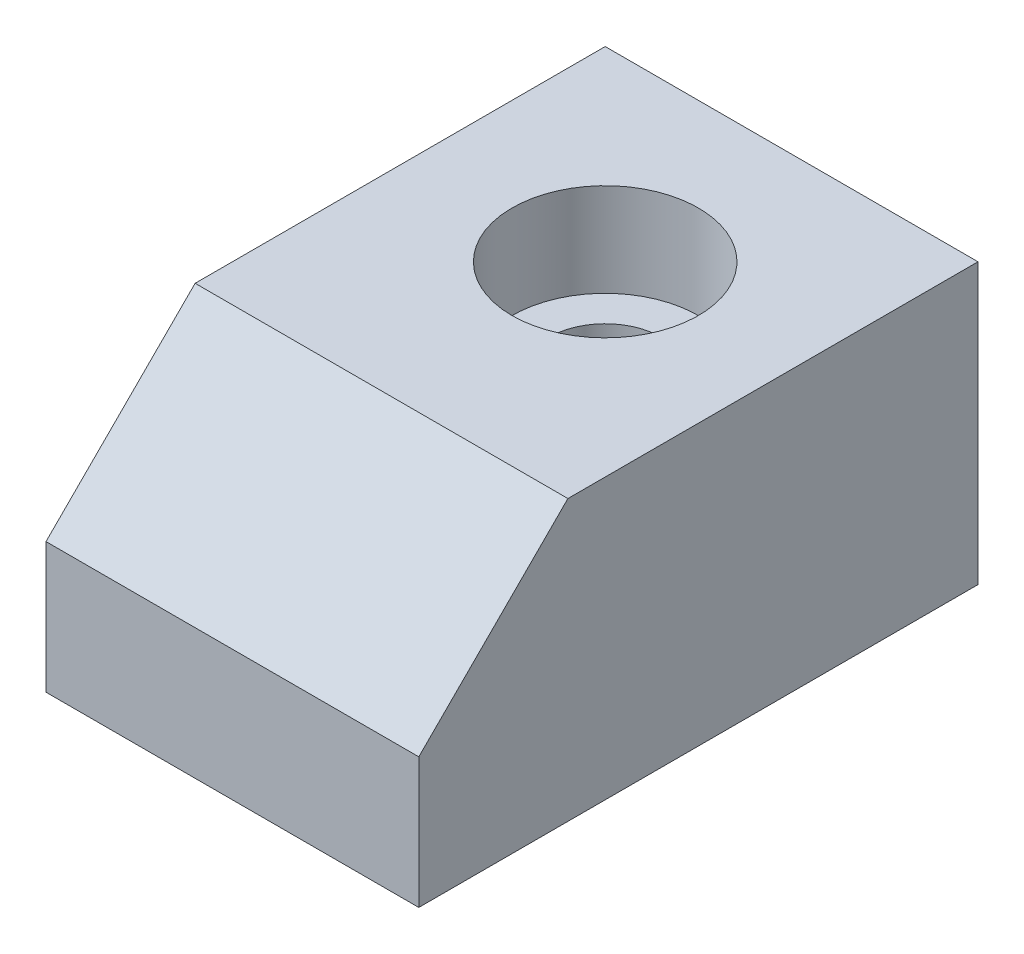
ISO-10303-21;
HEADER;
FILE_DESCRIPTION(('STEP AP214'),'2;1');
FILE_NAME('part.step','',(''),(''),'','','');
FILE_SCHEMA(('AUTOMOTIVE_DESIGN { 1 0 10303 214 1 1 1 1 }'));
ENDSEC;
DATA;
#1=APPLICATION_CONTEXT('core data for automotive mechanical design processes');
#2=APPLICATION_PROTOCOL_DEFINITION('international standard','automotive_design',2000,#1);
#3=PRODUCT_CONTEXT('',#1,'mechanical');
#4=PRODUCT('Part','Part','',(#3));
#5=PRODUCT_RELATED_PRODUCT_CATEGORY('part','',(#4));
#6=PRODUCT_DEFINITION_FORMATION('','',#4);
#7=PRODUCT_DEFINITION_CONTEXT('part definition',#1,'design');
#8=PRODUCT_DEFINITION('design','',#6,#7);
#9=PRODUCT_DEFINITION_SHAPE('','',#8);
#10=(LENGTH_UNIT() NAMED_UNIT(*) SI_UNIT(.MILLI.,.METRE.));
#11=(NAMED_UNIT(*) PLANE_ANGLE_UNIT() SI_UNIT($,.RADIAN.));
#12=(NAMED_UNIT(*) SI_UNIT($,.STERADIAN.) SOLID_ANGLE_UNIT());
#13=UNCERTAINTY_MEASURE_WITH_UNIT(LENGTH_MEASURE(1.E-05),#10,'distance_accuracy_value','');
#14=(GEOMETRIC_REPRESENTATION_CONTEXT(3) GLOBAL_UNCERTAINTY_ASSIGNED_CONTEXT((#13)) GLOBAL_UNIT_ASSIGNED_CONTEXT((#10,
#11,#12)) REPRESENTATION_CONTEXT('',''));
#15=CARTESIAN_POINT('',(0.,0.,0.));
#16=DIRECTION('',(0.,0.,1.));
#17=DIRECTION('',(1.,0.,0.));
#18=AXIS2_PLACEMENT_3D('',#15,#16,#17);
#19=CARTESIAN_POINT('',(20.,-7.5,-15.));
#20=DIRECTION('',(0.,0.,1.));
#21=DIRECTION('',(1.,0.,0.));
#22=AXIS2_PLACEMENT_3D('',#19,#20,#21);
#23=PLANE('',#22);
#24=DIRECTION('',(0.,1.,0.));
#25=VECTOR('',#24,1.);
#26=CARTESIAN_POINT('',(0.,-7.5,-15.));
#27=LINE('',#26,#25);
#28=CARTESIAN_POINT('',(0.,-7.5,-15.));
#29=VERTEX_POINT('',#28);
#30=CARTESIAN_POINT('',(0.,7.5,-15.));
#31=VERTEX_POINT('',#30);
#32=EDGE_CURVE('E108',#29,#31,#27,.T.);
#33=ORIENTED_EDGE('',*,*,#32,.T.);
#34=DIRECTION('',(-1.,0.,0.));
#35=VECTOR('',#34,1.);
#36=CARTESIAN_POINT('',(20.,7.5,-15.));
#37=LINE('',#36,#35);
#38=CARTESIAN_POINT('',(20.,7.5,-15.));
#39=VERTEX_POINT('',#38);
#40=EDGE_CURVE('E11',#39,#31,#37,.T.);
#41=ORIENTED_EDGE('',*,*,#40,.F.);
#42=DIRECTION('',(0.,1.,0.));
#43=VECTOR('',#42,1.);
#44=CARTESIAN_POINT('',(20.,-7.5,-15.));
#45=LINE('',#44,#43);
#46=CARTESIAN_POINT('',(20.,-7.5,-15.));
#47=VERTEX_POINT('',#46);
#48=EDGE_CURVE('E106',#47,#39,#45,.T.);
#49=ORIENTED_EDGE('',*,*,#48,.F.);
#50=DIRECTION('',(-1.,0.,0.));
#51=VECTOR('',#50,1.);
#52=CARTESIAN_POINT('',(20.,-7.5,-15.));
#53=LINE('',#52,#51);
#54=EDGE_CURVE('E112',#47,#29,#53,.T.);
#55=ORIENTED_EDGE('',*,*,#54,.T.);
#56=EDGE_LOOP('',(#33,#41,#49,#55));
#57=FACE_BOUND('',#56,.T.);
#58=ADVANCED_FACE('F33',(#57),#23,.F.);
#59=CARTESIAN_POINT('',(20.,7.5,15.));
#60=DIRECTION('',(0.,-1.,0.));
#61=DIRECTION('',(0.,0.,-1.));
#62=AXIS2_PLACEMENT_3D('',#59,#60,#61);
#63=PLANE('',#62);
#64=CARTESIAN_POINT('',(10.,7.5,-5.));
#65=DIRECTION('',(0.,1.,0.));
#66=DIRECTION('',(0.,0.,1.));
#67=AXIS2_PLACEMENT_3D('',#64,#65,#66);
#68=CIRCLE('',#67,5.);
#69=CARTESIAN_POINT('',(10.,7.5,0.));
#70=VERTEX_POINT('',#69);
#71=EDGE_CURVE('E134',#70,#70,#68,.T.);
#72=ORIENTED_EDGE('',*,*,#71,.F.);
#73=EDGE_LOOP('',(#72));
#74=FACE_BOUND('',#73,.T.);
#75=DIRECTION('',(0.,0.,1.));
#76=VECTOR('',#75,1.);
#77=CARTESIAN_POINT('',(0.,7.5,15.));
#78=LINE('',#77,#76);
#79=CARTESIAN_POINT('',(0.,7.5,7.00000000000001));
#80=VERTEX_POINT('',#79);
#81=EDGE_CURVE('E104',#31,#80,#78,.T.);
#82=ORIENTED_EDGE('',*,*,#81,.T.);
#83=DIRECTION('',(1.,0.,0.));
#84=VECTOR('',#83,1.);
#85=CARTESIAN_POINT('',(0.,7.5,7.));
#86=LINE('',#85,#84);
#87=CARTESIAN_POINT('',(20.,7.5,7.));
#88=VERTEX_POINT('',#87);
#89=EDGE_CURVE('E47',#80,#88,#86,.T.);
#90=ORIENTED_EDGE('',*,*,#89,.T.);
#91=DIRECTION('',(0.,0.,1.));
#92=VECTOR('',#91,1.);
#93=CARTESIAN_POINT('',(20.,7.5,15.));
#94=LINE('',#93,#92);
#95=EDGE_CURVE('E78',#39,#88,#94,.T.);
#96=ORIENTED_EDGE('',*,*,#95,.F.);
#97=ORIENTED_EDGE('',*,*,#40,.T.);
#98=EDGE_LOOP('',(#82,#90,#96,#97));
#99=FACE_BOUND('',#98,.T.);
#100=ADVANCED_FACE('F133',(#74,#99),#63,.F.);
#101=CARTESIAN_POINT('',(20.,-7.5,15.));
#102=DIRECTION('',(0.,0.,-1.));
#103=DIRECTION('',(-1.,0.,0.));
#104=AXIS2_PLACEMENT_3D('',#101,#102,#103);
#105=PLANE('',#104);
#106=DIRECTION('',(0.,-1.,0.));
#107=VECTOR('',#106,1.);
#108=CARTESIAN_POINT('',(20.,-7.5,15.));
#109=LINE('',#108,#107);
#110=CARTESIAN_POINT('',(20.,-0.5,15.));
#111=VERTEX_POINT('',#110);
#112=CARTESIAN_POINT('',(20.,-7.5,15.));
#113=VERTEX_POINT('',#112);
#114=EDGE_CURVE('E100',#111,#113,#109,.T.);
#115=ORIENTED_EDGE('',*,*,#114,.F.);
#116=DIRECTION('',(1.,0.,0.));
#117=VECTOR('',#116,1.);
#118=CARTESIAN_POINT('',(0.,-0.5,15.));
#119=LINE('',#118,#117);
#120=CARTESIAN_POINT('',(0.,-0.5,15.));
#121=VERTEX_POINT('',#120);
#122=EDGE_CURVE('E88',#121,#111,#119,.T.);
#123=ORIENTED_EDGE('',*,*,#122,.F.);
#124=DIRECTION('',(0.,-1.,0.));
#125=VECTOR('',#124,1.);
#126=CARTESIAN_POINT('',(0.,-7.5,15.));
#127=LINE('',#126,#125);
#128=CARTESIAN_POINT('',(0.,-7.5,15.));
#129=VERTEX_POINT('',#128);
#130=EDGE_CURVE('E99',#121,#129,#127,.T.);
#131=ORIENTED_EDGE('',*,*,#130,.T.);
#132=DIRECTION('',(-1.,0.,0.));
#133=VECTOR('',#132,1.);
#134=CARTESIAN_POINT('',(20.,-7.5,15.));
#135=LINE('',#134,#133);
#136=EDGE_CURVE('E40',#113,#129,#135,.T.);
#137=ORIENTED_EDGE('',*,*,#136,.F.);
#138=EDGE_LOOP('',(#115,#123,#131,#137));
#139=FACE_BOUND('',#138,.T.);
#140=ADVANCED_FACE('F97',(#139),#105,.F.);
#141=CARTESIAN_POINT('',(20.,-7.5,15.));
#142=DIRECTION('',(0.,1.,0.));
#143=DIRECTION('',(0.,0.,1.));
#144=AXIS2_PLACEMENT_3D('',#141,#142,#143);
#145=PLANE('',#144);
#146=CARTESIAN_POINT('',(10.,-7.5,-5.));
#147=DIRECTION('',(0.,1.,0.));
#148=DIRECTION('',(0.,0.,1.));
#149=AXIS2_PLACEMENT_3D('',#146,#147,#148);
#150=CIRCLE('',#149,3.);
#151=CARTESIAN_POINT('',(10.,-7.5,-2.));
#152=VERTEX_POINT('',#151);
#153=EDGE_CURVE('E119',#152,#152,#150,.T.);
#154=ORIENTED_EDGE('',*,*,#153,.T.);
#155=EDGE_LOOP('',(#154));
#156=FACE_BOUND('',#155,.T.);
#157=DIRECTION('',(0.,0.,-1.));
#158=VECTOR('',#157,1.);
#159=CARTESIAN_POINT('',(0.,-7.5,15.));
#160=LINE('',#159,#158);
#161=EDGE_CURVE('E73',#129,#29,#160,.T.);
#162=ORIENTED_EDGE('',*,*,#161,.T.);
#163=ORIENTED_EDGE('',*,*,#54,.F.);
#164=DIRECTION('',(0.,0.,-1.));
#165=VECTOR('',#164,1.);
#166=CARTESIAN_POINT('',(20.,-7.5,15.));
#167=LINE('',#166,#165);
#168=EDGE_CURVE('E56',#113,#47,#167,.T.);
#169=ORIENTED_EDGE('',*,*,#168,.F.);
#170=ORIENTED_EDGE('',*,*,#136,.T.);
#171=EDGE_LOOP('',(#162,#163,#169,#170));
#172=FACE_BOUND('',#171,.T.);
#173=ADVANCED_FACE('F113',(#156,#172),#145,.F.);
#174=CARTESIAN_POINT('',(20.,7.5,-15.));
#175=DIRECTION('',(-1.,0.,0.));
#176=DIRECTION('',(0.,0.,1.));
#177=AXIS2_PLACEMENT_3D('',#174,#175,#176);
#178=PLANE('',#177);
#179=ORIENTED_EDGE('',*,*,#95,.T.);
#180=DIRECTION('',(0.,0.707106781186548,-0.707106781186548));
#181=VECTOR('',#180,1.);
#182=CARTESIAN_POINT('',(20.,-0.5,15.));
#183=LINE('',#182,#181);
#184=EDGE_CURVE('E93',#111,#88,#183,.T.);
#185=ORIENTED_EDGE('',*,*,#184,.F.);
#186=ORIENTED_EDGE('',*,*,#114,.T.);
#187=ORIENTED_EDGE('',*,*,#168,.T.);
#188=ORIENTED_EDGE('',*,*,#48,.T.);
#189=EDGE_LOOP('',(#179,#185,#186,#187,#188));
#190=FACE_BOUND('',#189,.T.);
#191=ADVANCED_FACE('F132',(#190),#178,.F.);
#192=CARTESIAN_POINT('',(0.,7.5,-15.));
#193=DIRECTION('',(-1.,0.,0.));
#194=DIRECTION('',(0.,0.,1.));
#195=AXIS2_PLACEMENT_3D('',#192,#193,#194);
#196=PLANE('',#195);
#197=DIRECTION('',(0.,0.707106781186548,-0.707106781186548));
#198=VECTOR('',#197,1.);
#199=CARTESIAN_POINT('',(0.,-0.5,15.));
#200=LINE('',#199,#198);
#201=EDGE_CURVE('E85',#121,#80,#200,.T.);
#202=ORIENTED_EDGE('',*,*,#201,.T.);
#203=ORIENTED_EDGE('',*,*,#81,.F.);
#204=ORIENTED_EDGE('',*,*,#32,.F.);
#205=ORIENTED_EDGE('',*,*,#161,.F.);
#206=ORIENTED_EDGE('',*,*,#130,.F.);
#207=EDGE_LOOP('',(#202,#203,#204,#205,#206));
#208=FACE_BOUND('',#207,.T.);
#209=ADVANCED_FACE('F102',(#208),#196,.T.);
#210=CARTESIAN_POINT('',(10.,10.1510574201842,-5.));
#211=DIRECTION('',(0.,1.,0.));
#212=DIRECTION('',(0.,0.,1.));
#213=AXIS2_PLACEMENT_3D('',#210,#211,#212);
#214=CYLINDRICAL_SURFACE('',#213,3.);
#215=ORIENTED_EDGE('',*,*,#153,.F.);
#216=EDGE_LOOP('',(#215));
#217=FACE_BOUND('',#216,.T.);
#218=CARTESIAN_POINT('',(10.,2.5,-5.));
#219=DIRECTION('',(0.,1.,0.));
#220=DIRECTION('',(0.,0.,1.));
#221=AXIS2_PLACEMENT_3D('',#218,#219,#220);
#222=CIRCLE('',#221,3.);
#223=CARTESIAN_POINT('',(10.,2.5,-2.));
#224=VERTEX_POINT('',#223);
#225=EDGE_CURVE('E123',#224,#224,#222,.T.);
#226=ORIENTED_EDGE('',*,*,#225,.T.);
#227=EDGE_LOOP('',(#226));
#228=FACE_BOUND('',#227,.T.);
#229=ADVANCED_FACE('F161',(#217,#228),#214,.F.);
#230=CARTESIAN_POINT('',(10.,2.5,0.));
#231=DIRECTION('',(0.,-1.,0.));
#232=DIRECTION('',(0.,0.,-1.));
#233=AXIS2_PLACEMENT_3D('',#230,#231,#232);
#234=PLANE('',#233);
#235=ORIENTED_EDGE('',*,*,#225,.F.);
#236=EDGE_LOOP('',(#235));
#237=FACE_BOUND('',#236,.T.);
#238=CARTESIAN_POINT('',(10.,2.5,-5.));
#239=DIRECTION('',(0.,1.,0.));
#240=DIRECTION('',(0.,0.,1.));
#241=AXIS2_PLACEMENT_3D('',#238,#239,#240);
#242=CIRCLE('',#241,5.);
#243=CARTESIAN_POINT('',(10.,2.5,0.));
#244=VERTEX_POINT('',#243);
#245=EDGE_CURVE('E128',#244,#244,#242,.T.);
#246=ORIENTED_EDGE('',*,*,#245,.T.);
#247=EDGE_LOOP('',(#246));
#248=FACE_BOUND('',#247,.T.);
#249=ADVANCED_FACE('F142',(#237,#248),#234,.F.);
#250=CARTESIAN_POINT('',(10.,10.1510574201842,-5.));
#251=DIRECTION('',(0.,1.,0.));
#252=DIRECTION('',(0.,0.,1.));
#253=AXIS2_PLACEMENT_3D('',#250,#251,#252);
#254=CYLINDRICAL_SURFACE('',#253,5.);
#255=ORIENTED_EDGE('',*,*,#245,.F.);
#256=EDGE_LOOP('',(#255));
#257=FACE_BOUND('',#256,.T.);
#258=ORIENTED_EDGE('',*,*,#71,.T.);
#259=EDGE_LOOP('',(#258));
#260=FACE_BOUND('',#259,.T.);
#261=ADVANCED_FACE('F144',(#257,#260),#254,.F.);
#262=CARTESIAN_POINT('',(0.,-0.5,15.));
#263=DIRECTION('',(0.,-0.707106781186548,-0.707106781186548));
#264=DIRECTION('',(0.,0.707106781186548,-0.707106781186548));
#265=AXIS2_PLACEMENT_3D('',#262,#263,#264);
#266=PLANE('',#265);
#267=ORIENTED_EDGE('',*,*,#184,.T.);
#268=ORIENTED_EDGE('',*,*,#89,.F.);
#269=ORIENTED_EDGE('',*,*,#201,.F.);
#270=ORIENTED_EDGE('',*,*,#122,.T.);
#271=EDGE_LOOP('',(#267,#268,#269,#270));
#272=FACE_BOUND('',#271,.T.);
#273=ADVANCED_FACE('F87',(#272),#266,.F.);
#274=CLOSED_SHELL('',(#58,#100,#140,#173,#191,#209,#229,#249,#261,#273));
#275=MANIFOLD_SOLID_BREP('B2',#274);
#276=ADVANCED_BREP_SHAPE_REPRESENTATION('',(#18,#275),#14);
#277=SHAPE_DEFINITION_REPRESENTATION(#9,#276);
ENDSEC;
END-ISO-10303-21;
